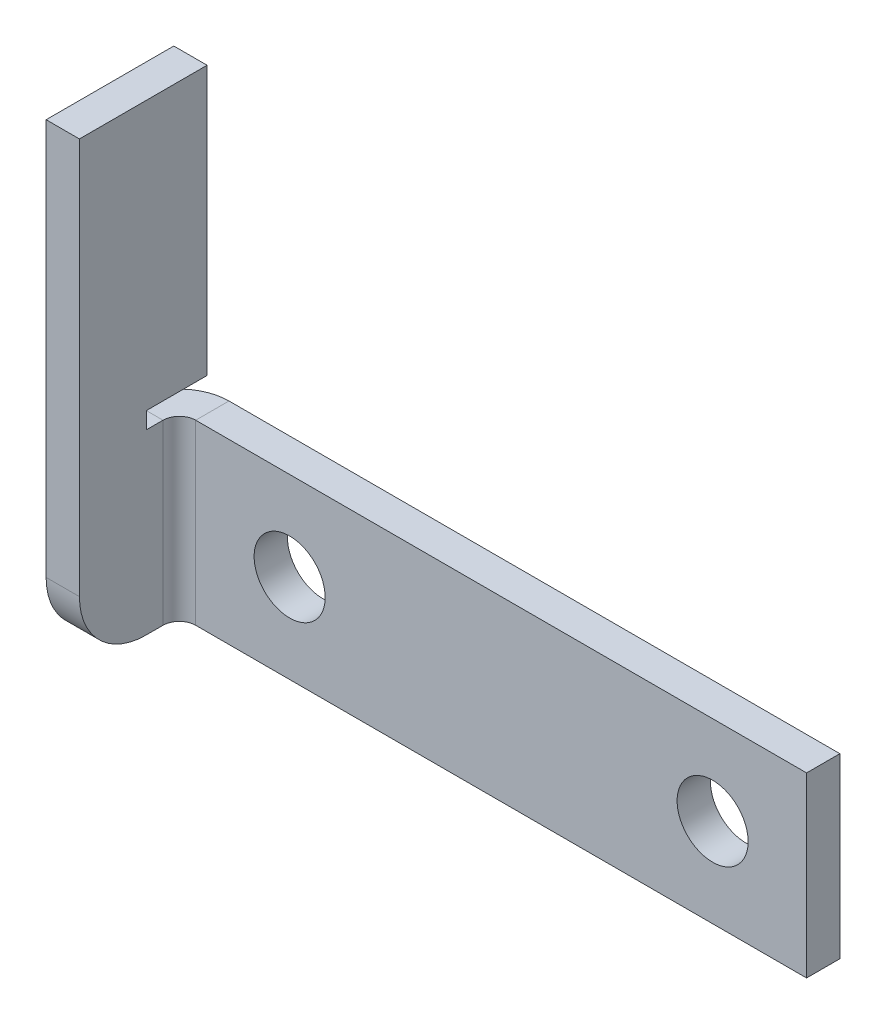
ISO-10303-21;
HEADER;
FILE_DESCRIPTION(('STEP AP214'),'2;1');
FILE_NAME('part.step','',(''),(''),'','','');
FILE_SCHEMA(('AUTOMOTIVE_DESIGN { 1 0 10303 214 1 1 1 1 }'));
ENDSEC;
DATA;
#1=APPLICATION_CONTEXT('core data for automotive mechanical design processes');
#2=APPLICATION_PROTOCOL_DEFINITION('international standard','automotive_design',2000,#1);
#3=PRODUCT_CONTEXT('',#1,'mechanical');
#4=PRODUCT('Part','Part','',(#3));
#5=PRODUCT_RELATED_PRODUCT_CATEGORY('part','',(#4));
#6=PRODUCT_DEFINITION_FORMATION('','',#4);
#7=PRODUCT_DEFINITION_CONTEXT('part definition',#1,'design');
#8=PRODUCT_DEFINITION('design','',#6,#7);
#9=PRODUCT_DEFINITION_SHAPE('','',#8);
#10=(LENGTH_UNIT() NAMED_UNIT(*) SI_UNIT(.MILLI.,.METRE.));
#11=(NAMED_UNIT(*) PLANE_ANGLE_UNIT() SI_UNIT($,.RADIAN.));
#12=(NAMED_UNIT(*) SI_UNIT($,.STERADIAN.) SOLID_ANGLE_UNIT());
#13=UNCERTAINTY_MEASURE_WITH_UNIT(LENGTH_MEASURE(1.E-05),#10,'distance_accuracy_value','');
#14=(GEOMETRIC_REPRESENTATION_CONTEXT(3) GLOBAL_UNCERTAINTY_ASSIGNED_CONTEXT((#13)) GLOBAL_UNIT_ASSIGNED_CONTEXT((#10,
#11,#12)) REPRESENTATION_CONTEXT('',''));
#15=CARTESIAN_POINT('',(0.,0.,0.));
#16=DIRECTION('',(0.,0.,1.));
#17=DIRECTION('',(1.,0.,0.));
#18=AXIS2_PLACEMENT_3D('',#15,#16,#17);
#19=CARTESIAN_POINT('',(-1.5,20.85245,0.25));
#20=DIRECTION('',(0.,0.,-1.));
#21=DIRECTION('',(0.,1.,0.));
#22=AXIS2_PLACEMENT_3D('',#19,#20,#21);
#23=PLANE('',#22);
#24=DIRECTION('',(0.,1.,0.));
#25=VECTOR('',#24,1.);
#26=CARTESIAN_POINT('',(0.,20.85245,0.25));
#27=LINE('',#26,#25);
#28=CARTESIAN_POINT('',(0.,8.75,0.249999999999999));
#29=VERTEX_POINT('',#28);
#30=CARTESIAN_POINT('',(0.,20.85245,0.25));
#31=VERTEX_POINT('',#30);
#32=EDGE_CURVE('E239',#29,#31,#27,.T.);
#33=ORIENTED_EDGE('',*,*,#32,.F.);
#34=DIRECTION('',(-1.,0.,0.));
#35=VECTOR('',#34,1.);
#36=CARTESIAN_POINT('',(-1.5,8.75,0.249999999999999));
#37=LINE('',#36,#35);
#38=CARTESIAN_POINT('',(-1.5,8.75,0.249999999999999));
#39=VERTEX_POINT('',#38);
#40=EDGE_CURVE('E237',#29,#39,#37,.T.);
#41=ORIENTED_EDGE('',*,*,#40,.T.);
#42=DIRECTION('',(0.,1.,0.));
#43=VECTOR('',#42,1.);
#44=CARTESIAN_POINT('',(-1.5,20.85245,0.25));
#45=LINE('',#44,#43);
#46=CARTESIAN_POINT('',(-1.5,20.85245,0.25));
#47=VERTEX_POINT('',#46);
#48=EDGE_CURVE('E240',#39,#47,#45,.T.);
#49=ORIENTED_EDGE('',*,*,#48,.T.);
#50=DIRECTION('',(1.,0.,0.));
#51=VECTOR('',#50,1.);
#52=CARTESIAN_POINT('',(-1.5,20.85245,0.25));
#53=LINE('',#52,#51);
#54=EDGE_CURVE('E251',#47,#31,#53,.T.);
#55=ORIENTED_EDGE('',*,*,#54,.T.);
#56=EDGE_LOOP('',(#33,#41,#49,#55));
#57=FACE_BOUND('',#56,.T.);
#58=ADVANCED_FACE('F58',(#57),#23,.T.);
#59=CARTESIAN_POINT('',(-1.5,0.,0.));
#60=DIRECTION('',(-1.,0.,0.));
#61=DIRECTION('',(0.,0.,1.));
#62=AXIS2_PLACEMENT_3D('',#59,#60,#61);
#63=PLANE('',#62);
#64=DIRECTION('',(0.,0.,-1.));
#65=VECTOR('',#64,1.);
#66=CARTESIAN_POINT('',(-1.5,0.,0.));
#67=LINE('',#66,#65);
#68=CARTESIAN_POINT('',(-1.5,0.,3.));
#69=VERTEX_POINT('',#68);
#70=CARTESIAN_POINT('',(-1.5,0.,2.2366));
#71=VERTEX_POINT('',#70);
#72=EDGE_CURVE('E249',#69,#71,#67,.T.);
#73=ORIENTED_EDGE('',*,*,#72,.F.);
#74=CARTESIAN_POINT('',(-1.5,3.,3.));
#75=DIRECTION('',(-1.,0.,0.));
#76=DIRECTION('',(0.,0.,1.));
#77=AXIS2_PLACEMENT_3D('',#74,#75,#76);
#78=CIRCLE('',#77,3.);
#79=CARTESIAN_POINT('',(-1.5,3.,6.));
#80=VERTEX_POINT('',#79);
#81=EDGE_CURVE('E13',#69,#80,#78,.T.);
#82=ORIENTED_EDGE('',*,*,#81,.T.);
#83=DIRECTION('',(0.,-1.,0.));
#84=VECTOR('',#83,1.);
#85=CARTESIAN_POINT('',(-1.5,0.,6.));
#86=LINE('',#85,#84);
#87=CARTESIAN_POINT('',(-1.5,20.85245,6.));
#88=VERTEX_POINT('',#87);
#89=EDGE_CURVE('E246',#88,#80,#86,.T.);
#90=ORIENTED_EDGE('',*,*,#89,.F.);
#91=DIRECTION('',(0.,0.,1.));
#92=VECTOR('',#91,1.);
#93=CARTESIAN_POINT('',(-1.5,20.85245,6.));
#94=LINE('',#93,#92);
#95=EDGE_CURVE('E242',#47,#88,#94,.T.);
#96=ORIENTED_EDGE('',*,*,#95,.F.);
#97=ORIENTED_EDGE('',*,*,#48,.F.);
#98=DIRECTION('',(0.,0.,1.));
#99=VECTOR('',#98,1.);
#100=CARTESIAN_POINT('',(-1.5,8.75,0.));
#101=LINE('',#100,#99);
#102=CARTESIAN_POINT('',(-1.5,8.75,2.9866));
#103=VERTEX_POINT('',#102);
#104=EDGE_CURVE('E235',#39,#103,#101,.T.);
#105=ORIENTED_EDGE('',*,*,#104,.T.);
#106=DIRECTION('',(0.,-1.,0.));
#107=VECTOR('',#106,1.);
#108=CARTESIAN_POINT('',(-1.5,0.,2.9866));
#109=LINE('',#108,#107);
#110=CARTESIAN_POINT('',(-1.5,8.,2.9866));
#111=VERTEX_POINT('',#110);
#112=EDGE_CURVE('E233',#103,#111,#109,.T.);
#113=ORIENTED_EDGE('',*,*,#112,.T.);
#114=DIRECTION('',(0.,0.,-1.));
#115=VECTOR('',#114,1.);
#116=CARTESIAN_POINT('',(-1.5,8.,0.));
#117=LINE('',#116,#115);
#118=CARTESIAN_POINT('',(-1.5,8.,2.2366));
#119=VERTEX_POINT('',#118);
#120=EDGE_CURVE('E222',#111,#119,#117,.T.);
#121=ORIENTED_EDGE('',*,*,#120,.T.);
#122=DIRECTION('',(0.,1.,0.));
#123=VECTOR('',#122,1.);
#124=CARTESIAN_POINT('',(-1.5,8.,2.2366));
#125=LINE('',#124,#123);
#126=EDGE_CURVE('E194',#119,#71,#125,.F.);
#127=ORIENTED_EDGE('',*,*,#126,.T.);
#128=EDGE_LOOP('',(#73,#82,#90,#96,#97,#105,#113,#121,#127));
#129=FACE_BOUND('',#128,.T.);
#130=ADVANCED_FACE('F284',(#129),#63,.T.);
#131=CARTESIAN_POINT('',(0.,0.,0.));
#132=DIRECTION('',(-1.,0.,0.));
#133=DIRECTION('',(0.,0.,1.));
#134=AXIS2_PLACEMENT_3D('',#131,#132,#133);
#135=PLANE('',#134);
#136=DIRECTION('',(0.,-1.,0.));
#137=VECTOR('',#136,1.);
#138=CARTESIAN_POINT('',(0.,0.,6.));
#139=LINE('',#138,#137);
#140=CARTESIAN_POINT('',(0.,20.85245,6.));
#141=VERTEX_POINT('',#140);
#142=CARTESIAN_POINT('',(0.,3.,6.));
#143=VERTEX_POINT('',#142);
#144=EDGE_CURVE('E256',#141,#143,#139,.T.);
#145=ORIENTED_EDGE('',*,*,#144,.T.);
#146=CARTESIAN_POINT('',(0.,3.,3.));
#147=DIRECTION('',(-1.,0.,0.));
#148=DIRECTION('',(0.,0.,1.));
#149=AXIS2_PLACEMENT_3D('',#146,#147,#148);
#150=CIRCLE('',#149,3.);
#151=CARTESIAN_POINT('',(0.,0.,3.));
#152=VERTEX_POINT('',#151);
#153=EDGE_CURVE('E80',#143,#152,#150,.F.);
#154=ORIENTED_EDGE('',*,*,#153,.T.);
#155=DIRECTION('',(0.,0.,-1.));
#156=VECTOR('',#155,1.);
#157=CARTESIAN_POINT('',(0.,0.,0.));
#158=LINE('',#157,#156);
#159=CARTESIAN_POINT('',(0.,0.,2.2366));
#160=VERTEX_POINT('',#159);
#161=EDGE_CURVE('E243',#152,#160,#158,.T.);
#162=ORIENTED_EDGE('',*,*,#161,.T.);
#163=DIRECTION('',(0.,1.,0.));
#164=VECTOR('',#163,1.);
#165=CARTESIAN_POINT('',(0.,8.,2.2366));
#166=LINE('',#165,#164);
#167=CARTESIAN_POINT('',(0.,8.,2.2366));
#168=VERTEX_POINT('',#167);
#169=EDGE_CURVE('E207',#168,#160,#166,.F.);
#170=ORIENTED_EDGE('',*,*,#169,.F.);
#171=DIRECTION('',(0.,0.,-1.));
#172=VECTOR('',#171,1.);
#173=CARTESIAN_POINT('',(0.,8.,2.9866));
#174=LINE('',#173,#172);
#175=CARTESIAN_POINT('',(0.,8.,2.9866));
#176=VERTEX_POINT('',#175);
#177=EDGE_CURVE('E224',#176,#168,#174,.T.);
#178=ORIENTED_EDGE('',*,*,#177,.F.);
#179=DIRECTION('',(0.,-1.,0.));
#180=VECTOR('',#179,1.);
#181=CARTESIAN_POINT('',(0.,8.75,2.9866));
#182=LINE('',#181,#180);
#183=CARTESIAN_POINT('',(0.,8.75,2.9866));
#184=VERTEX_POINT('',#183);
#185=EDGE_CURVE('E219',#184,#176,#182,.T.);
#186=ORIENTED_EDGE('',*,*,#185,.F.);
#187=DIRECTION('',(0.,0.,1.));
#188=VECTOR('',#187,1.);
#189=CARTESIAN_POINT('',(0.,8.75,0.));
#190=LINE('',#189,#188);
#191=EDGE_CURVE('E261',#29,#184,#190,.T.);
#192=ORIENTED_EDGE('',*,*,#191,.F.);
#193=ORIENTED_EDGE('',*,*,#32,.T.);
#194=DIRECTION('',(0.,0.,1.));
#195=VECTOR('',#194,1.);
#196=CARTESIAN_POINT('',(0.,20.85245,6.));
#197=LINE('',#196,#195);
#198=EDGE_CURVE('E253',#31,#141,#197,.T.);
#199=ORIENTED_EDGE('',*,*,#198,.T.);
#200=EDGE_LOOP('',(#145,#154,#162,#170,#178,#186,#192,#193,#199));
#201=FACE_BOUND('',#200,.T.);
#202=ADVANCED_FACE('F276',(#201),#135,.F.);
#203=CARTESIAN_POINT('',(-1.5,0.,0.));
#204=DIRECTION('',(0.,-1.,0.));
#205=DIRECTION('',(0.,0.,-1.));
#206=AXIS2_PLACEMENT_3D('',#203,#204,#205);
#207=PLANE('',#206);
#208=ORIENTED_EDGE('',*,*,#161,.F.);
#209=DIRECTION('',(1.,0.,0.));
#210=VECTOR('',#209,1.);
#211=CARTESIAN_POINT('',(-1.5,0.,3.));
#212=LINE('',#211,#210);
#213=EDGE_CURVE('E66',#152,#69,#212,.F.);
#214=ORIENTED_EDGE('',*,*,#213,.T.);
#215=ORIENTED_EDGE('',*,*,#72,.T.);
#216=DIRECTION('',(-1.,0.,0.));
#217=VECTOR('',#216,1.);
#218=CARTESIAN_POINT('',(0.,0.,2.2366));
#219=LINE('',#218,#217);
#220=EDGE_CURVE('E213',#160,#71,#219,.T.);
#221=ORIENTED_EDGE('',*,*,#220,.F.);
#222=EDGE_LOOP('',(#208,#214,#215,#221));
#223=FACE_BOUND('',#222,.T.);
#224=ADVANCED_FACE('F306',(#223),#207,.T.);
#225=CARTESIAN_POINT('',(-1.5,0.,6.));
#226=DIRECTION('',(0.,0.,1.));
#227=DIRECTION('',(1.,0.,0.));
#228=AXIS2_PLACEMENT_3D('',#225,#226,#227);
#229=PLANE('',#228);
#230=ORIENTED_EDGE('',*,*,#89,.T.);
#231=DIRECTION('',(1.,0.,0.));
#232=VECTOR('',#231,1.);
#233=CARTESIAN_POINT('',(-1.5,3.,6.));
#234=LINE('',#233,#232);
#235=EDGE_CURVE('E266',#80,#143,#234,.T.);
#236=ORIENTED_EDGE('',*,*,#235,.T.);
#237=ORIENTED_EDGE('',*,*,#144,.F.);
#238=DIRECTION('',(1.,0.,0.));
#239=VECTOR('',#238,1.);
#240=CARTESIAN_POINT('',(-1.5,20.85245,6.));
#241=LINE('',#240,#239);
#242=EDGE_CURVE('E259',#88,#141,#241,.T.);
#243=ORIENTED_EDGE('',*,*,#242,.F.);
#244=EDGE_LOOP('',(#230,#236,#237,#243));
#245=FACE_BOUND('',#244,.T.);
#246=ADVANCED_FACE('F272',(#245),#229,.T.);
#247=CARTESIAN_POINT('',(-1.5,20.85245,6.));
#248=DIRECTION('',(0.,1.,0.));
#249=DIRECTION('',(0.,0.,1.));
#250=AXIS2_PLACEMENT_3D('',#247,#248,#249);
#251=PLANE('',#250);
#252=ORIENTED_EDGE('',*,*,#198,.F.);
#253=ORIENTED_EDGE('',*,*,#54,.F.);
#254=ORIENTED_EDGE('',*,*,#95,.T.);
#255=ORIENTED_EDGE('',*,*,#242,.T.);
#256=EDGE_LOOP('',(#252,#253,#254,#255));
#257=FACE_BOUND('',#256,.T.);
#258=ADVANCED_FACE('F281',(#257),#251,.T.);
#259=CARTESIAN_POINT('',(0.,8.75,0.));
#260=DIRECTION('',(0.,-1.,0.));
#261=DIRECTION('',(0.,0.,-1.));
#262=AXIS2_PLACEMENT_3D('',#259,#260,#261);
#263=PLANE('',#262);
#264=ORIENTED_EDGE('',*,*,#40,.F.);
#265=ORIENTED_EDGE('',*,*,#191,.T.);
#266=DIRECTION('',(-1.,0.,0.));
#267=VECTOR('',#266,1.);
#268=CARTESIAN_POINT('',(0.,8.75,2.9866));
#269=LINE('',#268,#267);
#270=EDGE_CURVE('E223',#184,#103,#269,.T.);
#271=ORIENTED_EDGE('',*,*,#270,.T.);
#272=ORIENTED_EDGE('',*,*,#104,.F.);
#273=EDGE_LOOP('',(#264,#265,#271,#272));
#274=FACE_BOUND('',#273,.T.);
#275=ADVANCED_FACE('F303',(#274),#263,.T.);
#276=CARTESIAN_POINT('',(0.,8.75,2.9866));
#277=DIRECTION('',(0.,0.,-1.));
#278=DIRECTION('',(-1.,0.,0.));
#279=AXIS2_PLACEMENT_3D('',#276,#277,#278);
#280=PLANE('',#279);
#281=ORIENTED_EDGE('',*,*,#112,.F.);
#282=ORIENTED_EDGE('',*,*,#270,.F.);
#283=ORIENTED_EDGE('',*,*,#185,.T.);
#284=DIRECTION('',(-1.,0.,0.));
#285=VECTOR('',#284,1.);
#286=CARTESIAN_POINT('',(0.,8.,2.9866));
#287=LINE('',#286,#285);
#288=EDGE_CURVE('E216',#176,#111,#287,.T.);
#289=ORIENTED_EDGE('',*,*,#288,.T.);
#290=EDGE_LOOP('',(#281,#282,#283,#289));
#291=FACE_BOUND('',#290,.T.);
#292=ADVANCED_FACE('F313',(#291),#280,.T.);
#293=CARTESIAN_POINT('',(0.,8.,2.9866));
#294=DIRECTION('',(0.,1.,0.));
#295=DIRECTION('',(0.,0.,1.));
#296=AXIS2_PLACEMENT_3D('',#293,#294,#295);
#297=PLANE('',#296);
#298=ORIENTED_EDGE('',*,*,#120,.F.);
#299=ORIENTED_EDGE('',*,*,#288,.F.);
#300=ORIENTED_EDGE('',*,*,#177,.T.);
#301=DIRECTION('',(-1.,0.,0.));
#302=VECTOR('',#301,1.);
#303=CARTESIAN_POINT('',(0.,8.,2.2366));
#304=LINE('',#303,#302);
#305=EDGE_CURVE('E201',#168,#119,#304,.T.);
#306=ORIENTED_EDGE('',*,*,#305,.T.);
#307=EDGE_LOOP('',(#298,#299,#300,#306));
#308=FACE_BOUND('',#307,.T.);
#309=ADVANCED_FACE('F317',(#308),#297,.T.);
#310=CARTESIAN_POINT('',(0.736599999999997,0.,2.2366));
#311=DIRECTION('',(0.,-1.,0.));
#312=DIRECTION('',(0.,0.,-1.));
#313=AXIS2_PLACEMENT_3D('',#310,#311,#312);
#314=PLANE('',#313);
#315=DIRECTION('',(0.,0.,1.));
#316=VECTOR('',#315,1.);
#317=CARTESIAN_POINT('',(0.736599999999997,0.,0.));
#318=LINE('',#317,#316);
#319=CARTESIAN_POINT('',(0.736599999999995,0.,1.5));
#320=VERTEX_POINT('',#319);
#321=CARTESIAN_POINT('',(0.736599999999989,0.,0.));
#322=VERTEX_POINT('',#321);
#323=EDGE_CURVE('E175',#320,#322,#318,.F.);
#324=ORIENTED_EDGE('',*,*,#323,.F.);
#325=CARTESIAN_POINT('',(0.736599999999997,0.,2.2366));
#326=DIRECTION('',(0.,1.,0.));
#327=DIRECTION('',(0.,0.,1.));
#328=AXIS2_PLACEMENT_3D('',#325,#326,#327);
#329=CIRCLE('',#328,0.7366);
#330=EDGE_CURVE('E204',#160,#320,#329,.F.);
#331=ORIENTED_EDGE('',*,*,#330,.F.);
#332=ORIENTED_EDGE('',*,*,#220,.T.);
#333=CARTESIAN_POINT('',(0.736599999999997,0.,2.2366));
#334=DIRECTION('',(0.,1.,0.));
#335=DIRECTION('',(0.,0.,1.));
#336=AXIS2_PLACEMENT_3D('',#333,#334,#335);
#337=CIRCLE('',#336,2.2366);
#338=EDGE_CURVE('E197',#71,#322,#337,.F.);
#339=ORIENTED_EDGE('',*,*,#338,.T.);
#340=EDGE_LOOP('',(#324,#331,#332,#339));
#341=FACE_BOUND('',#340,.T.);
#342=ADVANCED_FACE('F321',(#341),#314,.T.);
#343=CARTESIAN_POINT('',(0.736599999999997,8.,2.2366));
#344=DIRECTION('',(0.,-1.,0.));
#345=DIRECTION('',(0.,0.,-1.));
#346=AXIS2_PLACEMENT_3D('',#343,#344,#345);
#347=PLANE('',#346);
#348=CARTESIAN_POINT('',(0.736599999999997,8.,2.2366));
#349=DIRECTION('',(0.,1.,0.));
#350=DIRECTION('',(0.,0.,1.));
#351=AXIS2_PLACEMENT_3D('',#348,#349,#350);
#352=CIRCLE('',#351,0.7366);
#353=CARTESIAN_POINT('',(0.736599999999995,8.,1.5));
#354=VERTEX_POINT('',#353);
#355=EDGE_CURVE('E210',#354,#168,#352,.T.);
#356=ORIENTED_EDGE('',*,*,#355,.F.);
#357=DIRECTION('',(0.,0.,1.));
#358=VECTOR('',#357,1.);
#359=CARTESIAN_POINT('',(0.736599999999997,8.,1.5));
#360=LINE('',#359,#358);
#361=CARTESIAN_POINT('',(0.736599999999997,8.,0.));
#362=VERTEX_POINT('',#361);
#363=EDGE_CURVE('E187',#354,#362,#360,.F.);
#364=ORIENTED_EDGE('',*,*,#363,.T.);
#365=CARTESIAN_POINT('',(0.736599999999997,8.,2.2366));
#366=DIRECTION('',(0.,1.,0.));
#367=DIRECTION('',(0.,0.,1.));
#368=AXIS2_PLACEMENT_3D('',#365,#366,#367);
#369=CIRCLE('',#368,2.2366);
#370=EDGE_CURVE('E198',#362,#119,#369,.T.);
#371=ORIENTED_EDGE('',*,*,#370,.T.);
#372=ORIENTED_EDGE('',*,*,#305,.F.);
#373=EDGE_LOOP('',(#356,#364,#371,#372));
#374=FACE_BOUND('',#373,.T.);
#375=ADVANCED_FACE('F323',(#374),#347,.F.);
#376=CARTESIAN_POINT('',(0.736599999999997,8.,2.2366));
#377=DIRECTION('',(0.,1.,0.));
#378=DIRECTION('',(0.,0.,-1.));
#379=AXIS2_PLACEMENT_3D('',#376,#377,#378);
#380=CYLINDRICAL_SURFACE('',#379,2.2366);
#381=ORIENTED_EDGE('',*,*,#126,.F.);
#382=ORIENTED_EDGE('',*,*,#370,.F.);
#383=DIRECTION('',(0.,1.,0.));
#384=VECTOR('',#383,1.);
#385=CARTESIAN_POINT('',(0.736599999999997,0.,0.));
#386=LINE('',#385,#384);
#387=EDGE_CURVE('E185',#362,#322,#386,.F.);
#388=ORIENTED_EDGE('',*,*,#387,.T.);
#389=ORIENTED_EDGE('',*,*,#338,.F.);
#390=EDGE_LOOP('',(#381,#382,#388,#389));
#391=FACE_BOUND('',#390,.T.);
#392=ADVANCED_FACE('F326',(#391),#380,.T.);
#393=CARTESIAN_POINT('',(0.736599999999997,8.,2.2366));
#394=DIRECTION('',(0.,1.,0.));
#395=DIRECTION('',(0.,0.,-1.));
#396=AXIS2_PLACEMENT_3D('',#393,#394,#395);
#397=CYLINDRICAL_SURFACE('',#396,0.7366);
#398=ORIENTED_EDGE('',*,*,#169,.T.);
#399=ORIENTED_EDGE('',*,*,#330,.T.);
#400=DIRECTION('',(0.,1.,0.));
#401=VECTOR('',#400,1.);
#402=CARTESIAN_POINT('',(0.736599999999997,0.,1.5));
#403=LINE('',#402,#401);
#404=EDGE_CURVE('E190',#320,#354,#403,.T.);
#405=ORIENTED_EDGE('',*,*,#404,.T.);
#406=ORIENTED_EDGE('',*,*,#355,.T.);
#407=EDGE_LOOP('',(#398,#399,#405,#406));
#408=FACE_BOUND('',#407,.T.);
#409=ADVANCED_FACE('F331',(#408),#397,.F.);
#410=CARTESIAN_POINT('',(28.25,8.,0.));
#411=DIRECTION('',(0.,-1.,0.));
#412=DIRECTION('',(0.,0.,-1.));
#413=AXIS2_PLACEMENT_3D('',#410,#411,#412);
#414=PLANE('',#413);
#415=ORIENTED_EDGE('',*,*,#363,.F.);
#416=DIRECTION('',(-1.,0.,0.));
#417=VECTOR('',#416,1.);
#418=CARTESIAN_POINT('',(28.25,8.,1.4999999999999));
#419=LINE('',#418,#417);
#420=CARTESIAN_POINT('',(28.25,8.,1.4999999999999));
#421=VERTEX_POINT('',#420);
#422=EDGE_CURVE('E183',#354,#421,#419,.F.);
#423=ORIENTED_EDGE('',*,*,#422,.T.);
#424=DIRECTION('',(0.,0.,1.));
#425=VECTOR('',#424,1.);
#426=CARTESIAN_POINT('',(28.25,8.,0.));
#427=LINE('',#426,#425);
#428=CARTESIAN_POINT('',(28.25,8.,0.));
#429=VERTEX_POINT('',#428);
#430=EDGE_CURVE('E171',#429,#421,#427,.T.);
#431=ORIENTED_EDGE('',*,*,#430,.F.);
#432=DIRECTION('',(1.,0.,0.));
#433=VECTOR('',#432,1.);
#434=CARTESIAN_POINT('',(0.,8.,0.));
#435=LINE('',#434,#433);
#436=EDGE_CURVE('E158',#362,#429,#435,.T.);
#437=ORIENTED_EDGE('',*,*,#436,.F.);
#438=EDGE_LOOP('',(#415,#423,#431,#437));
#439=FACE_BOUND('',#438,.T.);
#440=ADVANCED_FACE('F334',(#439),#414,.F.);
#441=CARTESIAN_POINT('',(0.,0.,0.));
#442=DIRECTION('',(0.,1.,0.));
#443=DIRECTION('',(0.,0.,1.));
#444=AXIS2_PLACEMENT_3D('',#441,#442,#443);
#445=PLANE('',#444);
#446=ORIENTED_EDGE('',*,*,#323,.T.);
#447=DIRECTION('',(-1.,0.,0.));
#448=VECTOR('',#447,1.);
#449=CARTESIAN_POINT('',(0.,0.,0.));
#450=LINE('',#449,#448);
#451=CARTESIAN_POINT('',(28.25,0.,0.));
#452=VERTEX_POINT('',#451);
#453=EDGE_CURVE('E156',#452,#322,#450,.T.);
#454=ORIENTED_EDGE('',*,*,#453,.F.);
#455=DIRECTION('',(0.,0.,1.));
#456=VECTOR('',#455,1.);
#457=CARTESIAN_POINT('',(28.25,0.,0.));
#458=LINE('',#457,#456);
#459=CARTESIAN_POINT('',(28.25,0.,1.4999999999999));
#460=VERTEX_POINT('',#459);
#461=EDGE_CURVE('E164',#452,#460,#458,.T.);
#462=ORIENTED_EDGE('',*,*,#461,.T.);
#463=DIRECTION('',(1.,0.,0.));
#464=VECTOR('',#463,1.);
#465=CARTESIAN_POINT('',(0.,0.,1.5));
#466=LINE('',#465,#464);
#467=EDGE_CURVE('E180',#460,#320,#466,.F.);
#468=ORIENTED_EDGE('',*,*,#467,.T.);
#469=EDGE_LOOP('',(#446,#454,#462,#468));
#470=FACE_BOUND('',#469,.T.);
#471=ADVANCED_FACE('F174',(#470),#445,.F.);
#472=CARTESIAN_POINT('',(0.,0.,0.));
#473=DIRECTION('',(0.,0.,1.));
#474=DIRECTION('',(1.,0.,0.));
#475=AXIS2_PLACEMENT_3D('',#472,#473,#474);
#476=PLANE('',#475);
#477=CARTESIAN_POINT('',(4.96830000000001,4.,0.));
#478=DIRECTION('',(0.,0.,1.));
#479=DIRECTION('',(1.,0.,0.));
#480=AXIS2_PLACEMENT_3D('',#477,#478,#479);
#481=CIRCLE('',#480,1.59999999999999);
#482=CARTESIAN_POINT('',(6.5683,4.,0.));
#483=VERTEX_POINT('',#482);
#484=EDGE_CURVE('E364',#483,#483,#481,.T.);
#485=ORIENTED_EDGE('',*,*,#484,.T.);
#486=EDGE_LOOP('',(#485));
#487=FACE_BOUND('',#486,.T.);
#488=CARTESIAN_POINT('',(24.0183,4.,0.));
#489=DIRECTION('',(0.,0.,1.));
#490=DIRECTION('',(1.,0.,0.));
#491=AXIS2_PLACEMENT_3D('',#488,#489,#490);
#492=CIRCLE('',#491,1.59999999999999);
#493=CARTESIAN_POINT('',(25.6183,4.,0.));
#494=VERTEX_POINT('',#493);
#495=EDGE_CURVE('E193',#494,#494,#492,.T.);
#496=ORIENTED_EDGE('',*,*,#495,.T.);
#497=EDGE_LOOP('',(#496));
#498=FACE_BOUND('',#497,.T.);
#499=ORIENTED_EDGE('',*,*,#387,.F.);
#500=ORIENTED_EDGE('',*,*,#436,.T.);
#501=DIRECTION('',(0.,-1.,0.));
#502=VECTOR('',#501,1.);
#503=CARTESIAN_POINT('',(28.25,0.,0.));
#504=LINE('',#503,#502);
#505=EDGE_CURVE('E151',#429,#452,#504,.T.);
#506=ORIENTED_EDGE('',*,*,#505,.T.);
#507=ORIENTED_EDGE('',*,*,#453,.T.);
#508=EDGE_LOOP('',(#499,#500,#506,#507));
#509=FACE_BOUND('',#508,.T.);
#510=ADVANCED_FACE('F154',(#487,#498,#509),#476,.F.);
#511=CARTESIAN_POINT('',(0.,0.,1.5));
#512=DIRECTION('',(0.,0.,1.));
#513=DIRECTION('',(1.,0.,0.));
#514=AXIS2_PLACEMENT_3D('',#511,#512,#513);
#515=PLANE('',#514);
#516=CARTESIAN_POINT('',(4.96830000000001,4.,1.5));
#517=DIRECTION('',(0.,0.,1.));
#518=DIRECTION('',(1.,0.,0.));
#519=AXIS2_PLACEMENT_3D('',#516,#517,#518);
#520=CIRCLE('',#519,1.59999999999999);
#521=CARTESIAN_POINT('',(6.5683,4.,1.5));
#522=VERTEX_POINT('',#521);
#523=EDGE_CURVE('E368',#522,#522,#520,.T.);
#524=ORIENTED_EDGE('',*,*,#523,.F.);
#525=EDGE_LOOP('',(#524));
#526=FACE_BOUND('',#525,.T.);
#527=CARTESIAN_POINT('',(24.0183,4.,1.5));
#528=DIRECTION('',(0.,0.,1.));
#529=DIRECTION('',(1.,0.,0.));
#530=AXIS2_PLACEMENT_3D('',#527,#528,#529);
#531=CIRCLE('',#530,1.59999999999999);
#532=CARTESIAN_POINT('',(25.6183,4.,1.5));
#533=VERTEX_POINT('',#532);
#534=EDGE_CURVE('E362',#533,#533,#531,.T.);
#535=ORIENTED_EDGE('',*,*,#534,.F.);
#536=EDGE_LOOP('',(#535));
#537=FACE_BOUND('',#536,.T.);
#538=ORIENTED_EDGE('',*,*,#422,.F.);
#539=ORIENTED_EDGE('',*,*,#404,.F.);
#540=ORIENTED_EDGE('',*,*,#467,.F.);
#541=DIRECTION('',(0.,1.,0.));
#542=VECTOR('',#541,1.);
#543=CARTESIAN_POINT('',(28.25,0.,1.4999999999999));
#544=LINE('',#543,#542);
#545=EDGE_CURVE('E167',#421,#460,#544,.F.);
#546=ORIENTED_EDGE('',*,*,#545,.F.);
#547=EDGE_LOOP('',(#538,#539,#540,#546));
#548=FACE_BOUND('',#547,.T.);
#549=ADVANCED_FACE('F344',(#526,#537,#548),#515,.T.);
#550=CARTESIAN_POINT('',(28.25,0.,0.));
#551=DIRECTION('',(-1.,0.,0.));
#552=DIRECTION('',(0.,0.,1.));
#553=AXIS2_PLACEMENT_3D('',#550,#551,#552);
#554=PLANE('',#553);
#555=ORIENTED_EDGE('',*,*,#545,.T.);
#556=ORIENTED_EDGE('',*,*,#461,.F.);
#557=ORIENTED_EDGE('',*,*,#505,.F.);
#558=ORIENTED_EDGE('',*,*,#430,.T.);
#559=EDGE_LOOP('',(#555,#556,#557,#558));
#560=FACE_BOUND('',#559,.T.);
#561=ADVANCED_FACE('F165',(#560),#554,.F.);
#562=CARTESIAN_POINT('',(24.0183,4.,1.5));
#563=DIRECTION('',(0.,0.,1.));
#564=DIRECTION('',(1.,0.,0.));
#565=AXIS2_PLACEMENT_3D('',#562,#563,#564);
#566=CYLINDRICAL_SURFACE('',#565,1.59999999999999);
#567=ORIENTED_EDGE('',*,*,#495,.F.);
#568=EDGE_LOOP('',(#567));
#569=FACE_BOUND('',#568,.T.);
#570=ORIENTED_EDGE('',*,*,#534,.T.);
#571=EDGE_LOOP('',(#570));
#572=FACE_BOUND('',#571,.T.);
#573=ADVANCED_FACE('F291',(#569,#572),#566,.F.);
#574=CARTESIAN_POINT('',(4.96830000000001,4.,1.5));
#575=DIRECTION('',(0.,0.,1.));
#576=DIRECTION('',(1.,0.,0.));
#577=AXIS2_PLACEMENT_3D('',#574,#575,#576);
#578=CYLINDRICAL_SURFACE('',#577,1.59999999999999);
#579=ORIENTED_EDGE('',*,*,#484,.F.);
#580=EDGE_LOOP('',(#579));
#581=FACE_BOUND('',#580,.T.);
#582=ORIENTED_EDGE('',*,*,#523,.T.);
#583=EDGE_LOOP('',(#582));
#584=FACE_BOUND('',#583,.T.);
#585=ADVANCED_FACE('F287',(#581,#584),#578,.F.);
#586=CARTESIAN_POINT('',(-1.5,3.,3.));
#587=DIRECTION('',(1.,0.,0.));
#588=DIRECTION('',(0.,0.,-1.));
#589=AXIS2_PLACEMENT_3D('',#586,#587,#588);
#590=CYLINDRICAL_SURFACE('',#589,3.);
#591=ORIENTED_EDGE('',*,*,#81,.F.);
#592=ORIENTED_EDGE('',*,*,#213,.F.);
#593=ORIENTED_EDGE('',*,*,#153,.F.);
#594=ORIENTED_EDGE('',*,*,#235,.F.);
#595=EDGE_LOOP('',(#591,#592,#593,#594));
#596=FACE_BOUND('',#595,.T.);
#597=ADVANCED_FACE('F60',(#596),#590,.T.);
#598=CLOSED_SHELL('',(#58,#130,#202,#224,#246,#258,#275,#292,#309,#342,#375,#392,#409,#440,#471,
#510,#549,#561,#573,#585,#597));
#599=MANIFOLD_SOLID_BREP('B2',#598);
#600=ADVANCED_BREP_SHAPE_REPRESENTATION('',(#18,#599),#14);
#601=SHAPE_DEFINITION_REPRESENTATION(#9,#600);
ENDSEC;
END-ISO-10303-21;
